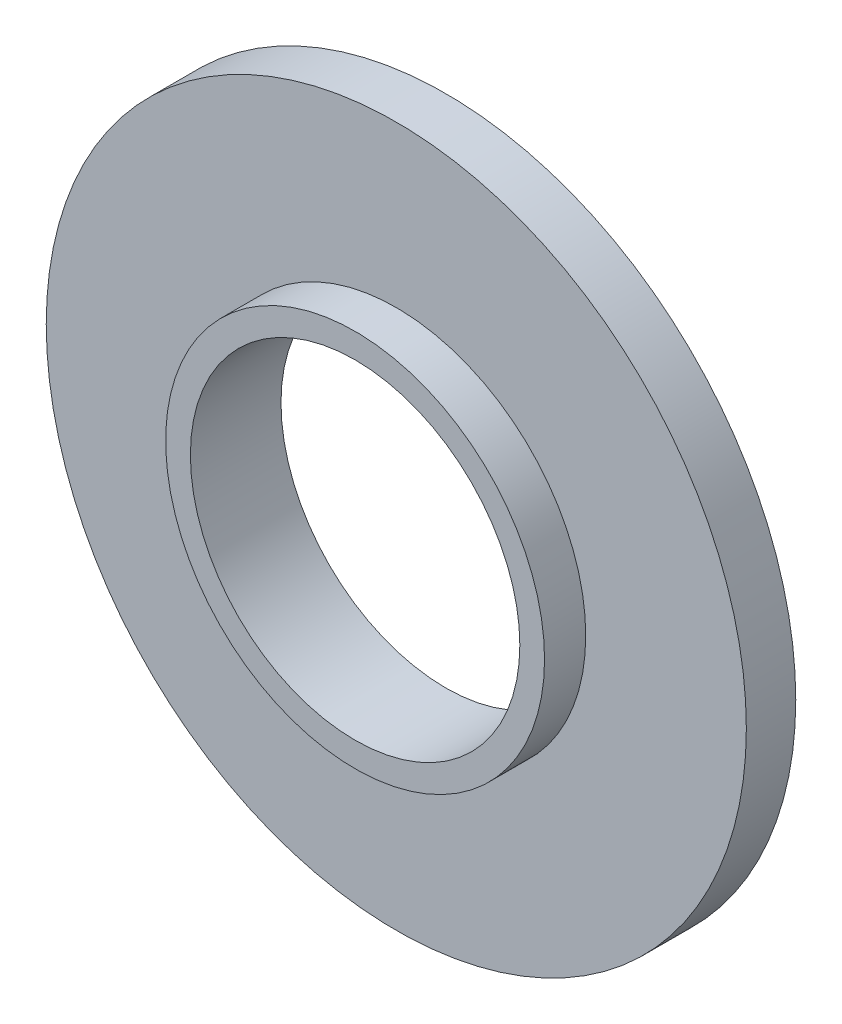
ISO-10303-21;
HEADER;
FILE_DESCRIPTION(('STEP AP214'),'2;1');
FILE_NAME('part.step','',(''),(''),'','','');
FILE_SCHEMA(('AUTOMOTIVE_DESIGN { 1 0 10303 214 1 1 1 1 }'));
ENDSEC;
DATA;
#1=APPLICATION_CONTEXT('core data for automotive mechanical design processes');
#2=APPLICATION_PROTOCOL_DEFINITION('international standard','automotive_design',2000,#1);
#3=PRODUCT_CONTEXT('',#1,'mechanical');
#4=PRODUCT('Part','Part','',(#3));
#5=PRODUCT_RELATED_PRODUCT_CATEGORY('part','',(#4));
#6=PRODUCT_DEFINITION_FORMATION('','',#4);
#7=PRODUCT_DEFINITION_CONTEXT('part definition',#1,'design');
#8=PRODUCT_DEFINITION('design','',#6,#7);
#9=PRODUCT_DEFINITION_SHAPE('','',#8);
#10=(LENGTH_UNIT() NAMED_UNIT(*) SI_UNIT(.MILLI.,.METRE.));
#11=(NAMED_UNIT(*) PLANE_ANGLE_UNIT() SI_UNIT($,.RADIAN.));
#12=(NAMED_UNIT(*) SI_UNIT($,.STERADIAN.) SOLID_ANGLE_UNIT());
#13=UNCERTAINTY_MEASURE_WITH_UNIT(LENGTH_MEASURE(1.E-05),#10,'distance_accuracy_value','');
#14=(GEOMETRIC_REPRESENTATION_CONTEXT(3) GLOBAL_UNCERTAINTY_ASSIGNED_CONTEXT((#13)) GLOBAL_UNIT_ASSIGNED_CONTEXT((#10,
#11,#12)) REPRESENTATION_CONTEXT('',''));
#15=CARTESIAN_POINT('',(0.,0.,0.));
#16=DIRECTION('',(0.,0.,1.));
#17=DIRECTION('',(1.,0.,0.));
#18=AXIS2_PLACEMENT_3D('',#15,#16,#17);
#19=CARTESIAN_POINT('',(0.,0.,1.2));
#20=DIRECTION('',(0.,0.,1.));
#21=DIRECTION('',(1.,0.,0.));
#22=AXIS2_PLACEMENT_3D('',#19,#20,#21);
#23=PLANE('',#22);
#24=CARTESIAN_POINT('',(0.,0.,1.2));
#25=DIRECTION('',(0.,0.,1.));
#26=DIRECTION('',(1.,0.,0.));
#27=AXIS2_PLACEMENT_3D('',#24,#25,#26);
#28=CIRCLE('',#27,8.5);
#29=CARTESIAN_POINT('',(8.5,0.,1.2));
#30=VERTEX_POINT('',#29);
#31=EDGE_CURVE('E10',#30,#30,#28,.T.);
#32=ORIENTED_EDGE('',*,*,#31,.T.);
#33=EDGE_LOOP('',(#32));
#34=FACE_BOUND('',#33,.T.);
#35=CARTESIAN_POINT('',(0.,0.,1.2));
#36=DIRECTION('',(0.,0.,1.));
#37=DIRECTION('',(1.,0.,0.));
#38=AXIS2_PLACEMENT_3D('',#35,#36,#37);
#39=CIRCLE('',#38,4.6);
#40=CARTESIAN_POINT('',(4.6,0.,1.2));
#41=VERTEX_POINT('',#40);
#42=EDGE_CURVE('E51',#41,#41,#39,.T.);
#43=ORIENTED_EDGE('',*,*,#42,.F.);
#44=EDGE_LOOP('',(#43));
#45=FACE_BOUND('',#44,.T.);
#46=ADVANCED_FACE('F35',(#34,#45),#23,.T.);
#47=CARTESIAN_POINT('',(0.,0.,0.));
#48=DIRECTION('',(0.,0.,1.));
#49=DIRECTION('',(1.,0.,0.));
#50=AXIS2_PLACEMENT_3D('',#47,#48,#49);
#51=PLANE('',#50);
#52=CARTESIAN_POINT('',(0.,0.,0.));
#53=DIRECTION('',(0.,0.,1.));
#54=DIRECTION('',(1.,0.,0.));
#55=AXIS2_PLACEMENT_3D('',#52,#53,#54);
#56=CIRCLE('',#55,8.5);
#57=CARTESIAN_POINT('',(8.5,0.,0.));
#58=VERTEX_POINT('',#57);
#59=EDGE_CURVE('E39',#58,#58,#56,.T.);
#60=ORIENTED_EDGE('',*,*,#59,.F.);
#61=EDGE_LOOP('',(#60));
#62=FACE_BOUND('',#61,.T.);
#63=CARTESIAN_POINT('',(0.,0.,0.));
#64=DIRECTION('',(0.,0.,1.));
#65=DIRECTION('',(1.,0.,0.));
#66=AXIS2_PLACEMENT_3D('',#63,#64,#65);
#67=CIRCLE('',#66,4.);
#68=CARTESIAN_POINT('',(4.,0.,0.));
#69=VERTEX_POINT('',#68);
#70=EDGE_CURVE('E46',#69,#69,#67,.T.);
#71=ORIENTED_EDGE('',*,*,#70,.T.);
#72=EDGE_LOOP('',(#71));
#73=FACE_BOUND('',#72,.T.);
#74=ADVANCED_FACE('F76',(#62,#73),#51,.F.);
#75=CARTESIAN_POINT('',(0.,0.,1.2));
#76=DIRECTION('',(0.,0.,-1.));
#77=DIRECTION('',(-1.,0.,0.));
#78=AXIS2_PLACEMENT_3D('',#75,#76,#77);
#79=CYLINDRICAL_SURFACE('',#78,8.5);
#80=ORIENTED_EDGE('',*,*,#31,.F.);
#81=EDGE_LOOP('',(#80));
#82=FACE_BOUND('',#81,.T.);
#83=ORIENTED_EDGE('',*,*,#59,.T.);
#84=EDGE_LOOP('',(#83));
#85=FACE_BOUND('',#84,.T.);
#86=ADVANCED_FACE('F37',(#82,#85),#79,.T.);
#87=CARTESIAN_POINT('',(0.,0.,1.2));
#88=DIRECTION('',(0.,0.,-1.));
#89=DIRECTION('',(-1.,0.,0.));
#90=AXIS2_PLACEMENT_3D('',#87,#88,#89);
#91=CYLINDRICAL_SURFACE('',#90,4.);
#92=ORIENTED_EDGE('',*,*,#70,.F.);
#93=EDGE_LOOP('',(#92));
#94=FACE_BOUND('',#93,.T.);
#95=CARTESIAN_POINT('',(0.,0.,2.2));
#96=DIRECTION('',(0.,0.,1.));
#97=DIRECTION('',(1.,0.,0.));
#98=AXIS2_PLACEMENT_3D('',#95,#96,#97);
#99=CIRCLE('',#98,4.);
#100=CARTESIAN_POINT('',(4.,0.,2.2));
#101=VERTEX_POINT('',#100);
#102=EDGE_CURVE('E54',#101,#101,#99,.T.);
#103=ORIENTED_EDGE('',*,*,#102,.T.);
#104=EDGE_LOOP('',(#103));
#105=FACE_BOUND('',#104,.T.);
#106=ADVANCED_FACE('F60',(#94,#105),#91,.F.);
#107=CARTESIAN_POINT('',(0.,0.,2.2));
#108=DIRECTION('',(0.,0.,1.));
#109=DIRECTION('',(1.,0.,0.));
#110=AXIS2_PLACEMENT_3D('',#107,#108,#109);
#111=PLANE('',#110);
#112=CARTESIAN_POINT('',(0.,0.,2.2));
#113=DIRECTION('',(0.,0.,1.));
#114=DIRECTION('',(1.,0.,0.));
#115=AXIS2_PLACEMENT_3D('',#112,#113,#114);
#116=CIRCLE('',#115,4.6);
#117=CARTESIAN_POINT('',(4.6,0.,2.2));
#118=VERTEX_POINT('',#117);
#119=EDGE_CURVE('E50',#118,#118,#116,.T.);
#120=ORIENTED_EDGE('',*,*,#119,.T.);
#121=EDGE_LOOP('',(#120));
#122=FACE_BOUND('',#121,.T.);
#123=ORIENTED_EDGE('',*,*,#102,.F.);
#124=EDGE_LOOP('',(#123));
#125=FACE_BOUND('',#124,.T.);
#126=ADVANCED_FACE('F62',(#122,#125),#111,.T.);
#127=CARTESIAN_POINT('',(0.,0.,2.2));
#128=DIRECTION('',(0.,0.,-1.));
#129=DIRECTION('',(-1.,0.,0.));
#130=AXIS2_PLACEMENT_3D('',#127,#128,#129);
#131=CYLINDRICAL_SURFACE('',#130,4.6);
#132=ORIENTED_EDGE('',*,*,#119,.F.);
#133=EDGE_LOOP('',(#132));
#134=FACE_BOUND('',#133,.T.);
#135=ORIENTED_EDGE('',*,*,#42,.T.);
#136=EDGE_LOOP('',(#135));
#137=FACE_BOUND('',#136,.T.);
#138=ADVANCED_FACE('F64',(#134,#137),#131,.T.);
#139=CLOSED_SHELL('',(#46,#74,#86,#106,#126,#138));
#140=MANIFOLD_SOLID_BREP('B2',#139);
#141=ADVANCED_BREP_SHAPE_REPRESENTATION('',(#18,#140),#14);
#142=SHAPE_DEFINITION_REPRESENTATION(#9,#141);
ENDSEC;
END-ISO-10303-21;
